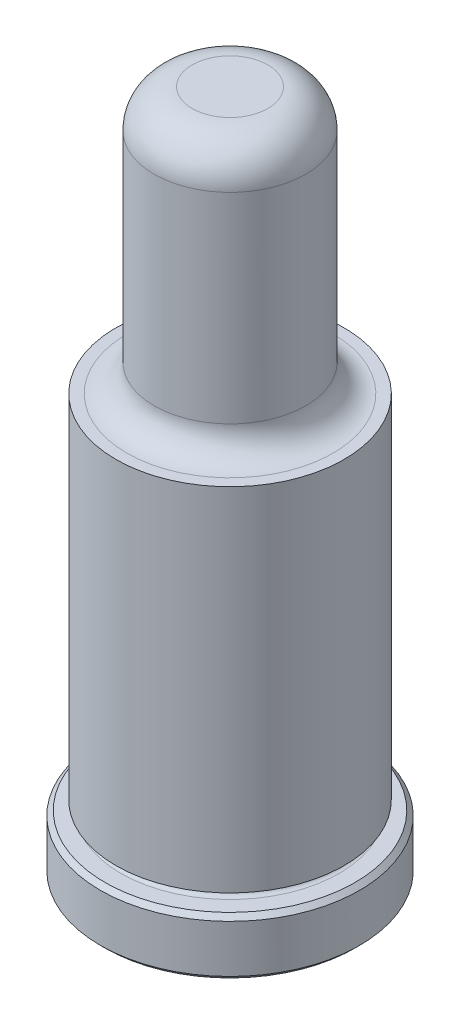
from build123d import *

# Parameters (mm, degrees)
CHAMFER1_SIZE = 0.381
FILLET1_R     = 3.175


with BuildPart() as part:
    # Sketch1 → Revolve1 (revolve)
    with BuildSketch(Plane(origin=(0, 0, 0), x_dir=(0, 0, -1), z_dir=(1, 0, 0)), mode=Mode.PRIVATE) as revolve1_sk:
        with BuildLine():
            Line((0, 0), (10.8331, 0))
            Line((10.8331, 0), (10.8331, 4.7498))
            Line((10.8331, 4.7498), (9.1313, 4.7498))
            ThreePointArc((9.1313, 4.7498), (8.7503, 5.1308), (9.1313, 5.5118))
            Line((9.1313, 5.5118), (9.5377, 5.5118))
            Line((9.5377, 5.5118), (9.5377, 34.925))
            Line((9.5377, 34.925), (8.6233, 34.925))
            ThreePointArc((8.6233, 34.925), (7.006853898, 35.594553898), (6.3373, 37.211))
            Line((6.3373, 37.211), (6.3373, 57.15))
            Line((6.3373, 57.15), (0, 57.15))
            Line((0, 57.15), (0, 0))
        make_face()
    revolve(revolve1_sk.sketch.rotate(Axis((0, 0, 0), (0, -1, 0)), 180), axis=Axis((0, 0, 0), (0, -1, 0)))

    # Chamfer1
    chamfer1_edges = [part.edges().sort_by_distance(p)[0] for p in [
        (0, 4.7498, -10.8331),
        (0, 0, -10.8331),
    ]]
    chamfer(chamfer1_edges, length=CHAMFER1_SIZE)

    # Fillet1
    fillet1_edges = [part.edges().sort_by_distance(p)[0] for p in [
        (0, 57.15, -6.3373),
    ]]
    fillet(fillet1_edges, radius=FILLET1_R)


solid = part.part
